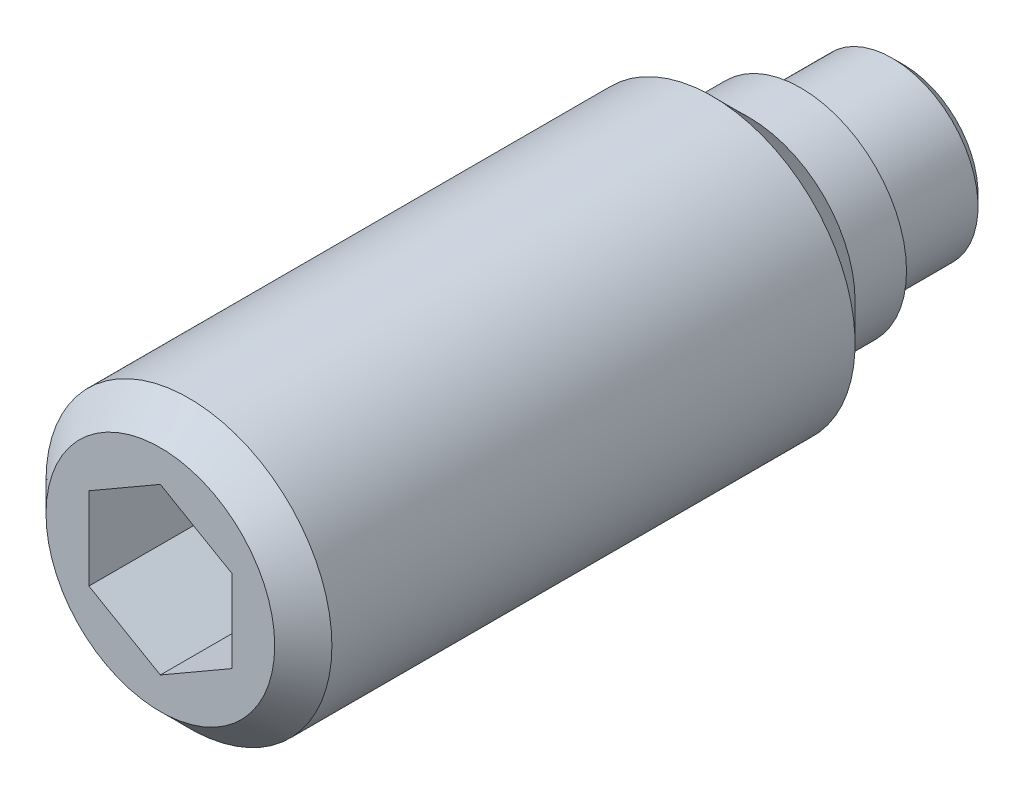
ISO-10303-21;
HEADER;
FILE_DESCRIPTION(('STEP AP214'),'2;1');
FILE_NAME('part.step','',(''),(''),'','','');
FILE_SCHEMA(('AUTOMOTIVE_DESIGN { 1 0 10303 214 1 1 1 1 }'));
ENDSEC;
DATA;
#1=APPLICATION_CONTEXT('core data for automotive mechanical design processes');
#2=APPLICATION_PROTOCOL_DEFINITION('international standard','automotive_design',2000,#1);
#3=PRODUCT_CONTEXT('',#1,'mechanical');
#4=PRODUCT('Part','Part','',(#3));
#5=PRODUCT_RELATED_PRODUCT_CATEGORY('part','',(#4));
#6=PRODUCT_DEFINITION_FORMATION('','',#4);
#7=PRODUCT_DEFINITION_CONTEXT('part definition',#1,'design');
#8=PRODUCT_DEFINITION('design','',#6,#7);
#9=PRODUCT_DEFINITION_SHAPE('','',#8);
#10=(LENGTH_UNIT() NAMED_UNIT(*) SI_UNIT(.MILLI.,.METRE.));
#11=(NAMED_UNIT(*) PLANE_ANGLE_UNIT() SI_UNIT($,.RADIAN.));
#12=(NAMED_UNIT(*) SI_UNIT($,.STERADIAN.) SOLID_ANGLE_UNIT());
#13=UNCERTAINTY_MEASURE_WITH_UNIT(LENGTH_MEASURE(1.E-05),#10,'distance_accuracy_value','');
#14=(GEOMETRIC_REPRESENTATION_CONTEXT(3) GLOBAL_UNCERTAINTY_ASSIGNED_CONTEXT((#13)) GLOBAL_UNIT_ASSIGNED_CONTEXT((#10,
#11,#12)) REPRESENTATION_CONTEXT('',''));
#15=CARTESIAN_POINT('',(0.,0.,0.));
#16=DIRECTION('',(0.,0.,1.));
#17=DIRECTION('',(1.,0.,0.));
#18=AXIS2_PLACEMENT_3D('',#15,#16,#17);
#19=CARTESIAN_POINT('',(0.,0.,1.8));
#20=DIRECTION('',(0.,0.,-1.));
#21=DIRECTION('',(-1.,0.,0.));
#22=AXIS2_PLACEMENT_3D('',#19,#20,#21);
#23=CYLINDRICAL_SURFACE('',#22,2.5);
#24=CARTESIAN_POINT('',(0.,0.,3.35));
#25=DIRECTION('',(0.,0.,-1.));
#26=DIRECTION('',(-1.,0.,0.));
#27=AXIS2_PLACEMENT_3D('',#24,#25,#26);
#28=CIRCLE('',#27,2.5);
#29=CARTESIAN_POINT('',(-2.5,0.,3.35));
#30=VERTEX_POINT('',#29);
#31=EDGE_CURVE('E9',#30,#30,#28,.T.);
#32=ORIENTED_EDGE('',*,*,#31,.F.);
#33=EDGE_LOOP('',(#32));
#34=FACE_BOUND('',#33,.T.);
#35=CARTESIAN_POINT('',(0.,0.,12.5));
#36=DIRECTION('',(0.,0.,1.));
#37=DIRECTION('',(1.,0.,0.));
#38=AXIS2_PLACEMENT_3D('',#35,#36,#37);
#39=CIRCLE('',#38,2.5);
#40=CARTESIAN_POINT('',(2.5,0.,12.5));
#41=VERTEX_POINT('',#40);
#42=EDGE_CURVE('E123',#41,#41,#39,.T.);
#43=ORIENTED_EDGE('',*,*,#42,.F.);
#44=EDGE_LOOP('',(#43));
#45=FACE_BOUND('',#44,.T.);
#46=ADVANCED_FACE('F14',(#34,#45),#23,.T.);
#47=CARTESIAN_POINT('',(0.,0.,3.35));
#48=DIRECTION('',(0.,0.,1.));
#49=DIRECTION('',(1.,0.,0.));
#50=AXIS2_PLACEMENT_3D('',#47,#48,#49);
#51=CONICAL_SURFACE('',#50,2.5,0.785398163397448);
#52=ORIENTED_EDGE('',*,*,#31,.T.);
#53=EDGE_LOOP('',(#52));
#54=FACE_BOUND('',#53,.T.);
#55=CARTESIAN_POINT('',(0.,0.,2.7));
#56=DIRECTION('',(0.,0.,-1.));
#57=DIRECTION('',(-1.,0.,0.));
#58=AXIS2_PLACEMENT_3D('',#55,#56,#57);
#59=CIRCLE('',#58,1.85);
#60=CARTESIAN_POINT('',(-1.85,0.,2.7));
#61=VERTEX_POINT('',#60);
#62=EDGE_CURVE('E21',#61,#61,#59,.T.);
#63=ORIENTED_EDGE('',*,*,#62,.F.);
#64=EDGE_LOOP('',(#63));
#65=FACE_BOUND('',#64,.T.);
#66=ADVANCED_FACE('F143',(#54,#65),#51,.T.);
#67=CARTESIAN_POINT('',(0.,0.,1.8));
#68=DIRECTION('',(0.,0.,-1.));
#69=DIRECTION('',(-1.,0.,0.));
#70=AXIS2_PLACEMENT_3D('',#67,#68,#69);
#71=CYLINDRICAL_SURFACE('',#70,1.85);
#72=ORIENTED_EDGE('',*,*,#62,.T.);
#73=EDGE_LOOP('',(#72));
#74=FACE_BOUND('',#73,.T.);
#75=CARTESIAN_POINT('',(0.,0.,1.8));
#76=DIRECTION('',(0.,0.,-1.));
#77=DIRECTION('',(-1.,0.,0.));
#78=AXIS2_PLACEMENT_3D('',#75,#76,#77);
#79=CIRCLE('',#78,1.85);
#80=CARTESIAN_POINT('',(-1.85,0.,1.8));
#81=VERTEX_POINT('',#80);
#82=EDGE_CURVE('E135',#81,#81,#79,.T.);
#83=ORIENTED_EDGE('',*,*,#82,.F.);
#84=EDGE_LOOP('',(#83));
#85=FACE_BOUND('',#84,.T.);
#86=ADVANCED_FACE('F140',(#74,#85),#71,.T.);
#87=CARTESIAN_POINT('',(0.,1.85,1.8));
#88=DIRECTION('',(0.,0.,1.));
#89=DIRECTION('',(1.,0.,0.));
#90=AXIS2_PLACEMENT_3D('',#87,#88,#89);
#91=PLANE('',#90);
#92=ORIENTED_EDGE('',*,*,#82,.T.);
#93=EDGE_LOOP('',(#92));
#94=FACE_BOUND('',#93,.T.);
#95=CARTESIAN_POINT('',(0.,0.,1.8));
#96=DIRECTION('',(0.,0.,-1.));
#97=DIRECTION('',(-1.,0.,0.));
#98=AXIS2_PLACEMENT_3D('',#95,#96,#97);
#99=CIRCLE('',#98,1.5);
#100=CARTESIAN_POINT('',(-1.5,0.,1.8));
#101=VERTEX_POINT('',#100);
#102=EDGE_CURVE('E132',#101,#101,#99,.T.);
#103=ORIENTED_EDGE('',*,*,#102,.F.);
#104=EDGE_LOOP('',(#103));
#105=FACE_BOUND('',#104,.T.);
#106=ADVANCED_FACE('F151',(#94,#105),#91,.F.);
#107=CARTESIAN_POINT('',(0.,0.,0.));
#108=DIRECTION('',(0.,0.,-1.));
#109=DIRECTION('',(-1.,0.,0.));
#110=AXIS2_PLACEMENT_3D('',#107,#108,#109);
#111=CYLINDRICAL_SURFACE('',#110,1.5);
#112=CARTESIAN_POINT('',(0.,0.,0.2));
#113=DIRECTION('',(0.,0.,-1.));
#114=DIRECTION('',(-1.,0.,0.));
#115=AXIS2_PLACEMENT_3D('',#112,#113,#114);
#116=CIRCLE('',#115,1.5);
#117=CARTESIAN_POINT('',(-1.5,0.,0.2));
#118=VERTEX_POINT('',#117);
#119=EDGE_CURVE('E129',#118,#118,#116,.T.);
#120=ORIENTED_EDGE('',*,*,#119,.F.);
#121=EDGE_LOOP('',(#120));
#122=FACE_BOUND('',#121,.T.);
#123=ORIENTED_EDGE('',*,*,#102,.T.);
#124=EDGE_LOOP('',(#123));
#125=FACE_BOUND('',#124,.T.);
#126=ADVANCED_FACE('F157',(#122,#125),#111,.T.);
#127=CARTESIAN_POINT('',(0.,0.,0.2));
#128=DIRECTION('',(0.,0.,1.));
#129=DIRECTION('',(1.,0.,0.));
#130=AXIS2_PLACEMENT_3D('',#127,#128,#129);
#131=CONICAL_SURFACE('',#130,1.5,0.785398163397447);
#132=CARTESIAN_POINT('',(0.,0.,0.));
#133=DIRECTION('',(0.,0.,-1.));
#134=DIRECTION('',(-1.,0.,0.));
#135=AXIS2_PLACEMENT_3D('',#132,#133,#134);
#136=CIRCLE('',#135,1.3);
#137=CARTESIAN_POINT('',(-1.3,0.,0.));
#138=VERTEX_POINT('',#137);
#139=EDGE_CURVE('E126',#138,#138,#136,.T.);
#140=ORIENTED_EDGE('',*,*,#139,.F.);
#141=EDGE_LOOP('',(#140));
#142=FACE_BOUND('',#141,.T.);
#143=ORIENTED_EDGE('',*,*,#119,.T.);
#144=EDGE_LOOP('',(#143));
#145=FACE_BOUND('',#144,.T.);
#146=ADVANCED_FACE('F161',(#142,#145),#131,.T.);
#147=CARTESIAN_POINT('',(0.,1.3,0.));
#148=DIRECTION('',(0.,0.,1.));
#149=DIRECTION('',(1.,0.,0.));
#150=AXIS2_PLACEMENT_3D('',#147,#148,#149);
#151=PLANE('',#150);
#152=ORIENTED_EDGE('',*,*,#139,.T.);
#153=EDGE_LOOP('',(#152));
#154=FACE_BOUND('',#153,.T.);
#155=ADVANCED_FACE('F165',(#154),#151,.F.);
#156=CARTESIAN_POINT('',(0.,0.,13.));
#157=DIRECTION('',(0.,0.,-1.));
#158=DIRECTION('',(-1.,0.,0.));
#159=AXIS2_PLACEMENT_3D('',#156,#157,#158);
#160=CONICAL_SURFACE('',#159,2.,0.78539816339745);
#161=ORIENTED_EDGE('',*,*,#42,.T.);
#162=EDGE_LOOP('',(#161));
#163=FACE_BOUND('',#162,.T.);
#164=CARTESIAN_POINT('',(0.,0.,13.));
#165=DIRECTION('',(0.,0.,1.));
#166=DIRECTION('',(1.,0.,0.));
#167=AXIS2_PLACEMENT_3D('',#164,#165,#166);
#168=CIRCLE('',#167,2.);
#169=CARTESIAN_POINT('',(2.,0.,13.));
#170=VERTEX_POINT('',#169);
#171=EDGE_CURVE('E115',#170,#170,#168,.T.);
#172=ORIENTED_EDGE('',*,*,#171,.F.);
#173=EDGE_LOOP('',(#172));
#174=FACE_BOUND('',#173,.T.);
#175=ADVANCED_FACE('F169',(#163,#174),#160,.T.);
#176=CARTESIAN_POINT('',(0.,-2.,13.));
#177=DIRECTION('',(0.,0.,1.));
#178=DIRECTION('',(1.,0.,0.));
#179=AXIS2_PLACEMENT_3D('',#176,#177,#178);
#180=PLANE('',#179);
#181=DIRECTION('',(0.866025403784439,-0.5,0.));
#182=VECTOR('',#181,1.);
#183=CARTESIAN_POINT('',(-1.25,-0.721687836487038,13.));
#184=LINE('',#183,#182);
#185=CARTESIAN_POINT('',(-1.25,-0.721687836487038,13.));
#186=VERTEX_POINT('',#185);
#187=CARTESIAN_POINT('',(0.,-1.44337567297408,13.));
#188=VERTEX_POINT('',#187);
#189=EDGE_CURVE('E28',#186,#188,#184,.T.);
#190=ORIENTED_EDGE('',*,*,#189,.F.);
#191=DIRECTION('',(0.,-1.,0.));
#192=VECTOR('',#191,1.);
#193=CARTESIAN_POINT('',(-1.25,0.721687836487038,13.));
#194=LINE('',#193,#192);
#195=CARTESIAN_POINT('',(-1.25,0.721687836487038,13.));
#196=VERTEX_POINT('',#195);
#197=EDGE_CURVE('E111',#196,#186,#194,.T.);
#198=ORIENTED_EDGE('',*,*,#197,.F.);
#199=DIRECTION('',(-0.866025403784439,-0.5,0.));
#200=VECTOR('',#199,1.);
#201=CARTESIAN_POINT('',(0.,1.44337567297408,13.));
#202=LINE('',#201,#200);
#203=CARTESIAN_POINT('',(0.,1.44337567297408,13.));
#204=VERTEX_POINT('',#203);
#205=EDGE_CURVE('E109',#204,#196,#202,.T.);
#206=ORIENTED_EDGE('',*,*,#205,.F.);
#207=DIRECTION('',(-0.866025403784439,0.5,0.));
#208=VECTOR('',#207,1.);
#209=CARTESIAN_POINT('',(1.25,0.721687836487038,13.));
#210=LINE('',#209,#208);
#211=CARTESIAN_POINT('',(1.25,0.721687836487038,13.));
#212=VERTEX_POINT('',#211);
#213=EDGE_CURVE('E76',#212,#204,#210,.T.);
#214=ORIENTED_EDGE('',*,*,#213,.F.);
#215=DIRECTION('',(0.,1.,0.));
#216=VECTOR('',#215,1.);
#217=CARTESIAN_POINT('',(1.25,-0.721687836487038,13.));
#218=LINE('',#217,#216);
#219=CARTESIAN_POINT('',(1.25,-0.721687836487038,13.));
#220=VERTEX_POINT('',#219);
#221=EDGE_CURVE('E105',#220,#212,#218,.T.);
#222=ORIENTED_EDGE('',*,*,#221,.F.);
#223=DIRECTION('',(0.866025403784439,0.5,0.));
#224=VECTOR('',#223,1.);
#225=CARTESIAN_POINT('',(0.,-1.44337567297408,13.));
#226=LINE('',#225,#224);
#227=EDGE_CURVE('E102',#188,#220,#226,.T.);
#228=ORIENTED_EDGE('',*,*,#227,.F.);
#229=EDGE_LOOP('',(#190,#198,#206,#214,#222,#228));
#230=FACE_BOUND('',#229,.T.);
#231=ORIENTED_EDGE('',*,*,#171,.T.);
#232=EDGE_LOOP('',(#231));
#233=FACE_BOUND('',#232,.T.);
#234=ADVANCED_FACE('F173',(#230,#233),#180,.T.);
#235=CARTESIAN_POINT('',(-1.25,-0.721687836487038,10.));
#236=DIRECTION('',(-0.5,-0.866025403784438,0.));
#237=DIRECTION('',(0.866025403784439,-0.5,0.));
#238=AXIS2_PLACEMENT_3D('',#235,#236,#237);
#239=PLANE('',#238);
#240=ORIENTED_EDGE('',*,*,#189,.T.);
#241=DIRECTION('',(0.,0.,1.));
#242=VECTOR('',#241,1.);
#243=CARTESIAN_POINT('',(0.,-1.44337567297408,10.));
#244=LINE('',#243,#242);
#245=CARTESIAN_POINT('',(0.,-1.44337567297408,10.));
#246=VERTEX_POINT('',#245);
#247=EDGE_CURVE('E58',#246,#188,#244,.T.);
#248=ORIENTED_EDGE('',*,*,#247,.F.);
#249=DIRECTION('',(0.866025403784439,-0.5,0.));
#250=VECTOR('',#249,1.);
#251=CARTESIAN_POINT('',(-1.25,-0.721687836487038,10.));
#252=LINE('',#251,#250);
#253=CARTESIAN_POINT('',(-1.25,-0.721687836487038,10.));
#254=VERTEX_POINT('',#253);
#255=EDGE_CURVE('E113',#254,#246,#252,.T.);
#256=ORIENTED_EDGE('',*,*,#255,.F.);
#257=DIRECTION('',(0.,0.,1.));
#258=VECTOR('',#257,1.);
#259=CARTESIAN_POINT('',(-1.25,-0.721687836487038,10.));
#260=LINE('',#259,#258);
#261=EDGE_CURVE('E36',#254,#186,#260,.T.);
#262=ORIENTED_EDGE('',*,*,#261,.T.);
#263=EDGE_LOOP('',(#240,#248,#256,#262));
#264=FACE_BOUND('',#263,.T.);
#265=ADVANCED_FACE('F177',(#264),#239,.F.);
#266=CARTESIAN_POINT('',(-1.25,0.721687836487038,10.));
#267=DIRECTION('',(-1.,0.,0.));
#268=DIRECTION('',(0.,0.,1.));
#269=AXIS2_PLACEMENT_3D('',#266,#267,#268);
#270=PLANE('',#269);
#271=ORIENTED_EDGE('',*,*,#197,.T.);
#272=ORIENTED_EDGE('',*,*,#261,.F.);
#273=DIRECTION('',(0.,-1.,0.));
#274=VECTOR('',#273,1.);
#275=CARTESIAN_POINT('',(-1.25,0.721687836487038,10.));
#276=LINE('',#275,#274);
#277=CARTESIAN_POINT('',(-1.25,0.721687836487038,10.));
#278=VERTEX_POINT('',#277);
#279=EDGE_CURVE('E88',#278,#254,#276,.T.);
#280=ORIENTED_EDGE('',*,*,#279,.F.);
#281=DIRECTION('',(0.,0.,1.));
#282=VECTOR('',#281,1.);
#283=CARTESIAN_POINT('',(-1.25,0.721687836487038,10.));
#284=LINE('',#283,#282);
#285=EDGE_CURVE('E80',#278,#196,#284,.T.);
#286=ORIENTED_EDGE('',*,*,#285,.T.);
#287=EDGE_LOOP('',(#271,#272,#280,#286));
#288=FACE_BOUND('',#287,.T.);
#289=ADVANCED_FACE('F181',(#288),#270,.F.);
#290=CARTESIAN_POINT('',(0.,1.44337567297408,10.));
#291=DIRECTION('',(-0.5,0.866025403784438,0.));
#292=DIRECTION('',(-0.866025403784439,-0.5,0.));
#293=AXIS2_PLACEMENT_3D('',#290,#291,#292);
#294=PLANE('',#293);
#295=ORIENTED_EDGE('',*,*,#205,.T.);
#296=ORIENTED_EDGE('',*,*,#285,.F.);
#297=DIRECTION('',(-0.866025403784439,-0.5,0.));
#298=VECTOR('',#297,1.);
#299=CARTESIAN_POINT('',(0.,1.44337567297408,10.));
#300=LINE('',#299,#298);
#301=CARTESIAN_POINT('',(0.,1.44337567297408,10.));
#302=VERTEX_POINT('',#301);
#303=EDGE_CURVE('E84',#302,#278,#300,.T.);
#304=ORIENTED_EDGE('',*,*,#303,.F.);
#305=DIRECTION('',(0.,0.,1.));
#306=VECTOR('',#305,1.);
#307=CARTESIAN_POINT('',(0.,1.44337567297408,10.));
#308=LINE('',#307,#306);
#309=EDGE_CURVE('E69',#302,#204,#308,.T.);
#310=ORIENTED_EDGE('',*,*,#309,.T.);
#311=EDGE_LOOP('',(#295,#296,#304,#310));
#312=FACE_BOUND('',#311,.T.);
#313=ADVANCED_FACE('F85',(#312),#294,.F.);
#314=CARTESIAN_POINT('',(1.25,0.721687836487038,10.));
#315=DIRECTION('',(0.5,0.866025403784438,0.));
#316=DIRECTION('',(-0.866025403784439,0.5,0.));
#317=AXIS2_PLACEMENT_3D('',#314,#315,#316);
#318=PLANE('',#317);
#319=ORIENTED_EDGE('',*,*,#213,.T.);
#320=ORIENTED_EDGE('',*,*,#309,.F.);
#321=DIRECTION('',(-0.866025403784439,0.5,0.));
#322=VECTOR('',#321,1.);
#323=CARTESIAN_POINT('',(1.25,0.721687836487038,10.));
#324=LINE('',#323,#322);
#325=CARTESIAN_POINT('',(1.25,0.721687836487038,10.));
#326=VERTEX_POINT('',#325);
#327=EDGE_CURVE('E73',#326,#302,#324,.T.);
#328=ORIENTED_EDGE('',*,*,#327,.F.);
#329=DIRECTION('',(0.,0.,1.));
#330=VECTOR('',#329,1.);
#331=CARTESIAN_POINT('',(1.25,0.721687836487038,10.));
#332=LINE('',#331,#330);
#333=EDGE_CURVE('E81',#326,#212,#332,.T.);
#334=ORIENTED_EDGE('',*,*,#333,.T.);
#335=EDGE_LOOP('',(#319,#320,#328,#334));
#336=FACE_BOUND('',#335,.T.);
#337=ADVANCED_FACE('F71',(#336),#318,.F.);
#338=CARTESIAN_POINT('',(1.25,-0.721687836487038,10.));
#339=DIRECTION('',(1.,0.,0.));
#340=DIRECTION('',(0.,0.,-1.));
#341=AXIS2_PLACEMENT_3D('',#338,#339,#340);
#342=PLANE('',#341);
#343=ORIENTED_EDGE('',*,*,#221,.T.);
#344=ORIENTED_EDGE('',*,*,#333,.F.);
#345=DIRECTION('',(0.,1.,0.));
#346=VECTOR('',#345,1.);
#347=CARTESIAN_POINT('',(1.25,-0.721687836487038,10.));
#348=LINE('',#347,#346);
#349=CARTESIAN_POINT('',(1.25,-0.721687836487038,10.));
#350=VERTEX_POINT('',#349);
#351=EDGE_CURVE('E94',#350,#326,#348,.T.);
#352=ORIENTED_EDGE('',*,*,#351,.F.);
#353=DIRECTION('',(0.,0.,1.));
#354=VECTOR('',#353,1.);
#355=CARTESIAN_POINT('',(1.25,-0.721687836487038,10.));
#356=LINE('',#355,#354);
#357=EDGE_CURVE('E118',#350,#220,#356,.T.);
#358=ORIENTED_EDGE('',*,*,#357,.T.);
#359=EDGE_LOOP('',(#343,#344,#352,#358));
#360=FACE_BOUND('',#359,.T.);
#361=ADVANCED_FACE('F185',(#360),#342,.F.);
#362=CARTESIAN_POINT('',(0.,-1.44337567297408,10.));
#363=DIRECTION('',(0.5,-0.866025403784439,0.));
#364=DIRECTION('',(0.866025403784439,0.5,0.));
#365=AXIS2_PLACEMENT_3D('',#362,#363,#364);
#366=PLANE('',#365);
#367=ORIENTED_EDGE('',*,*,#227,.T.);
#368=ORIENTED_EDGE('',*,*,#357,.F.);
#369=DIRECTION('',(0.866025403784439,0.5,0.));
#370=VECTOR('',#369,1.);
#371=CARTESIAN_POINT('',(0.,-1.44337567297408,10.));
#372=LINE('',#371,#370);
#373=EDGE_CURVE('E96',#246,#350,#372,.T.);
#374=ORIENTED_EDGE('',*,*,#373,.F.);
#375=ORIENTED_EDGE('',*,*,#247,.T.);
#376=EDGE_LOOP('',(#367,#368,#374,#375));
#377=FACE_BOUND('',#376,.T.);
#378=ADVANCED_FACE('F182',(#377),#366,.F.);
#379=CARTESIAN_POINT('',(0.,0.,10.));
#380=DIRECTION('',(0.,0.,1.));
#381=DIRECTION('',(1.,0.,0.));
#382=AXIS2_PLACEMENT_3D('',#379,#380,#381);
#383=PLANE('',#382);
#384=ORIENTED_EDGE('',*,*,#255,.T.);
#385=ORIENTED_EDGE('',*,*,#373,.T.);
#386=ORIENTED_EDGE('',*,*,#351,.T.);
#387=ORIENTED_EDGE('',*,*,#327,.T.);
#388=ORIENTED_EDGE('',*,*,#303,.T.);
#389=ORIENTED_EDGE('',*,*,#279,.T.);
#390=EDGE_LOOP('',(#384,#385,#386,#387,#388,#389));
#391=FACE_BOUND('',#390,.T.);
#392=ADVANCED_FACE('F91',(#391),#383,.T.);
#393=CLOSED_SHELL('',(#46,#66,#86,#106,#126,#146,#155,#175,#234,#265,#289,#313,#337,#361,#378,#392));
#394=MANIFOLD_SOLID_BREP('B1',#393);
#395=ADVANCED_BREP_SHAPE_REPRESENTATION('',(#18,#394),#14);
#396=SHAPE_DEFINITION_REPRESENTATION(#9,#395);
ENDSEC;
END-ISO-10303-21;
